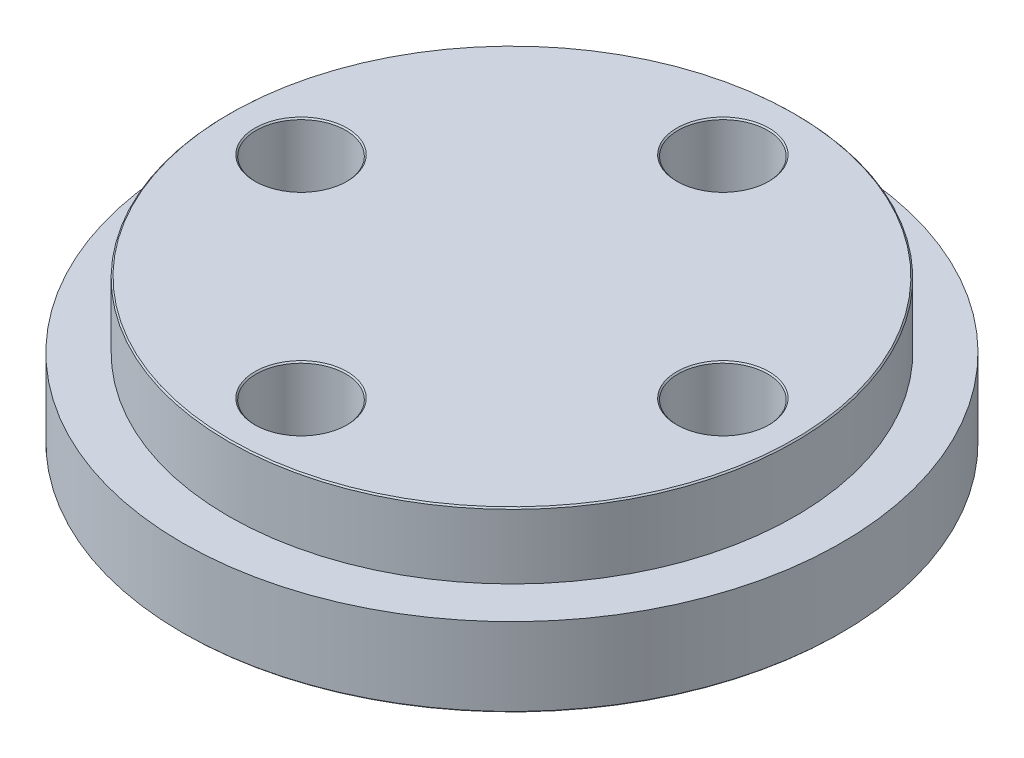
from build123d import *

# Parameters (mm, degrees)
SKETCH_1_R               = 25
EXTRUDE_1_DEPTH          = 6
SKETCH_2_R               = 21.5
EXTRUDE_2_DEPTH          = 5
SKETCH_3_R               = 3.4
CUT_EXTRUDE_1_DEPTH      = 38.027017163
PATTERN_CIRCULAR_1_COUNT = 4
CHAMFER_1_SIZE           = 0.1


with BuildPart() as part:
    # Sketch 1 → Extrude 1 (new body)
    with BuildSketch(Plane(origin=(0, 0, 0), x_dir=(1, 0, 0), z_dir=(0, 1, 0))):
        with Locations(Location((0, 0, 0), (0, 0, 270))):
            Circle(SKETCH_1_R)
    extrude(amount=EXTRUDE_1_DEPTH)

    # Sketch 2 → Extrude 2 (add)
    with BuildSketch(Plane(origin=(0, 6, 0), x_dir=(1, 0, 0), z_dir=(0, 1, 0))):
        with Locations(Location((0, 0, 0), (0, 0, 270))):
            Circle(SKETCH_2_R)
    extrude(amount=EXTRUDE_2_DEPTH)

    # Sketch 3 → Cut-Extrude 1 (cut, through all)
    with BuildSketch(Plane.XZ):
        with Locations(Location((0, 16, 0), (0, 0, 270))):
            Circle(SKETCH_3_R)
    cut_extrude_1 = extrude(amount=-CUT_EXTRUDE_1_DEPTH, mode=Mode.SUBTRACT)

    # Pattern Circular 1: Cut-Extrude 1 ×4 about axis
    pattern_circular_1_axis = Axis((0, 0, 0), (0, 1, 0))
    for i in range(1, PATTERN_CIRCULAR_1_COUNT):
        add(cut_extrude_1.rotate(pattern_circular_1_axis, i * 360 / PATTERN_CIRCULAR_1_COUNT), mode=Mode.SUBTRACT)

    # Chamfer 1
    chamfer_1_edges = [part.edges().sort_by_distance(p)[0] for p in [
        (0, 11, 19.4),
        (0, 0, 19.4),
        (-19.4, 11, 0),
        (-19.4, 0, 0),
        (0, 0, -25),
        (0, 11, -19.4),
        (0, 0, -19.4),
        (19.4, 11, 0),
        (19.4, 0, 0),
        (0, 11, -21.5),
    ]]
    chamfer(chamfer_1_edges, length=CHAMFER_1_SIZE)


solid = part.part
